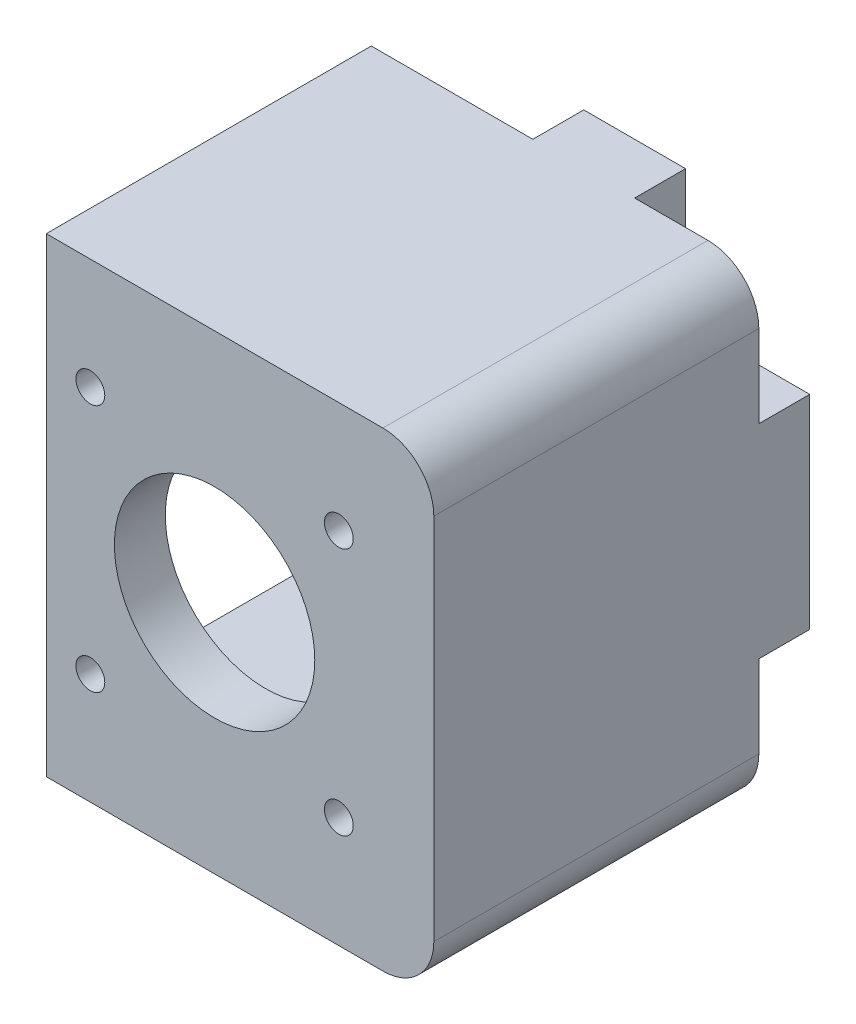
from build123d import *

# Parameters (mm, degrees)
SKETCH2_W           = 6.35
SKETCH2_H           = 42
SKETCH2_H_2         = 6.35
SKETCH2_W_2         = 22.987
BOSS_EXTRUDE1_DEPTH = 34.2
SKETCH3_W           = 48.35
SKETCH3_H           = 58.674
BOSS_EXTRUDE2_DEPTH = 6.35
SKETCH5_R           = 12.5
SKETCH5_R_2         = 1.8
CUT_EXTRUDE1_DEPTH  = 87.166485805
SKETCH6_W           = 6.35
SKETCH6_H           = 25.4
SKETCH6_W_2         = 12.7
SKETCH6_H_2         = 6.35
BOSS_EXTRUDE3_DEPTH = 6.35
FILLET1_R           = 6.35


with BuildPart() as part:
    # Sketch2 → Boss-Extrude1 (new body)
    with BuildSketch(Plane(origin=(0, 0, 0), x_dir=(0, 1, 0), z_dir=(0, 0, 1))):
        with Locations((3.175, 27.35)):
            Rectangle(SKETCH2_W, SKETCH2_H)
        with Locations((3.175, 3.175)):
            Rectangle(SKETCH2_W, SKETCH2_H_2)
        with Locations((17.8435, 3.175)):
            Rectangle(SKETCH2_W_2, SKETCH2_H_2)
        with Locations((40.8305, 3.175)):
            Rectangle(SKETCH2_W_2, SKETCH2_H_2)
        with Locations((55.499, 27.35)):
            Rectangle(SKETCH2_W, SKETCH2_H)
        with Locations((55.499, 3.175)):
            Rectangle(SKETCH2_W, SKETCH2_H_2)
    extrude(amount=BOSS_EXTRUDE1_DEPTH)

    # Sketch3 → Boss-Extrude2 (add)
    with BuildSketch(Plane.XY.offset(34.2)):
        with Locations((-24.175, 29.337)):
            Rectangle(SKETCH3_W, SKETCH3_H)
    extrude(amount=BOSS_EXTRUDE2_DEPTH)

    # Sketch5 → Cut-Extrude1 (cut, through all)
    with BuildSketch(Plane.XY.offset(40.55)):
        with Locations((-27.35, 29.337)):
            Circle(SKETCH5_R)
        with Locations((-42.85, 44.837)):
            Circle(SKETCH5_R_2)
        with Locations((-11.85, 44.837)):
            Circle(SKETCH5_R_2)
        with Locations((-11.85, 13.837)):
            Circle(SKETCH5_R_2)
        with Locations((-42.85, 13.837)):
            Circle(SKETCH5_R_2)
    extrude(amount=-CUT_EXTRUDE1_DEPTH, mode=Mode.SUBTRACT)

    # Sketch6 → Boss-Extrude3 (add)
    with BuildSketch(Plane(origin=(0, 0, 0), x_dir=(1, 0, 0), z_dir=(0, 0, -1))):
        with Locations((-3.175, -29.337)):
            Rectangle(SKETCH6_W, SKETCH6_H)
        with Locations((-21.844, -3.175)):
            Rectangle(SKETCH6_W_2, SKETCH6_H_2)
        with Locations((-21.844, -55.499)):
            Rectangle(SKETCH6_W_2, SKETCH6_H_2)
    extrude(amount=BOSS_EXTRUDE3_DEPTH)

    # Fillet1
    fillet1_edges = [part.edges().sort_by_distance(p)[0] for p in [
        (0, 58.674, 20.275),
        (0, 0, 20.275),
    ]]
    fillet(fillet1_edges, radius=FILLET1_R)


solid = part.part
